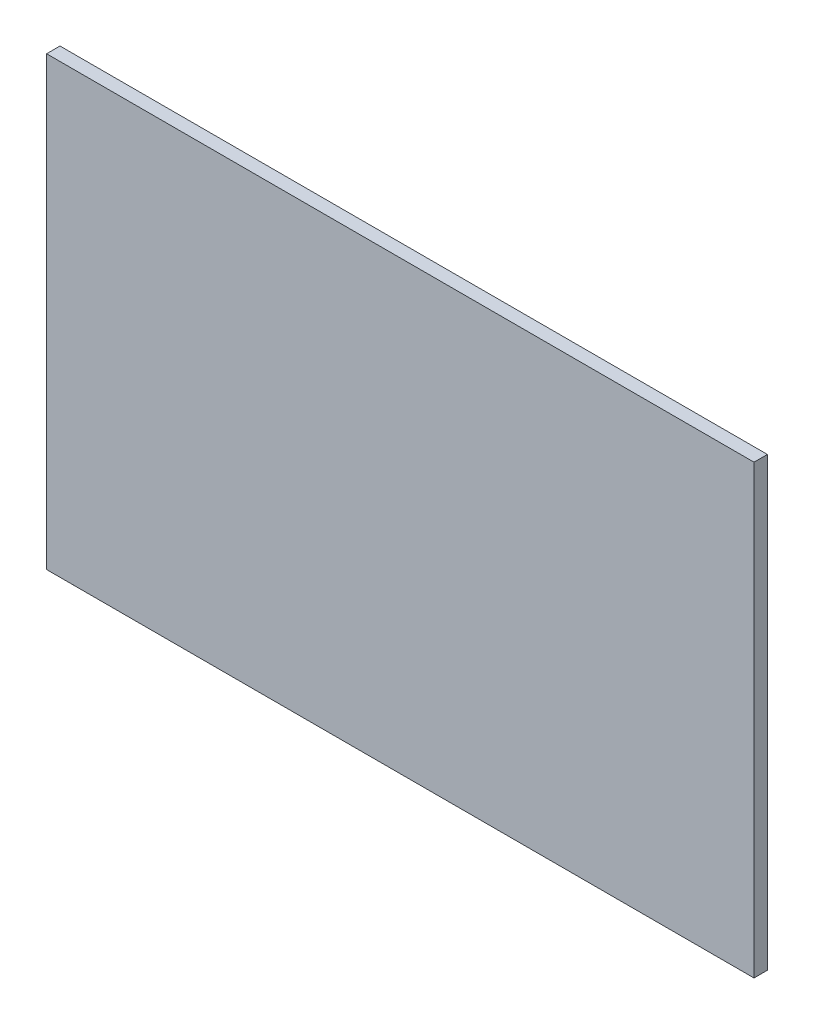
from build123d import *

# Parameters (mm, degrees)
SKETCH1_W           = 158.36
SKETCH1_H           = 100
BOSS_EXTRUDE1_DEPTH = 3


with BuildPart() as part:
    # Sketch1 → Boss-Extrude1 (new body)
    with BuildSketch(Plane.XY):
        Rectangle(SKETCH1_W, SKETCH1_H)
    extrude(amount=BOSS_EXTRUDE1_DEPTH)


solid = part.part
